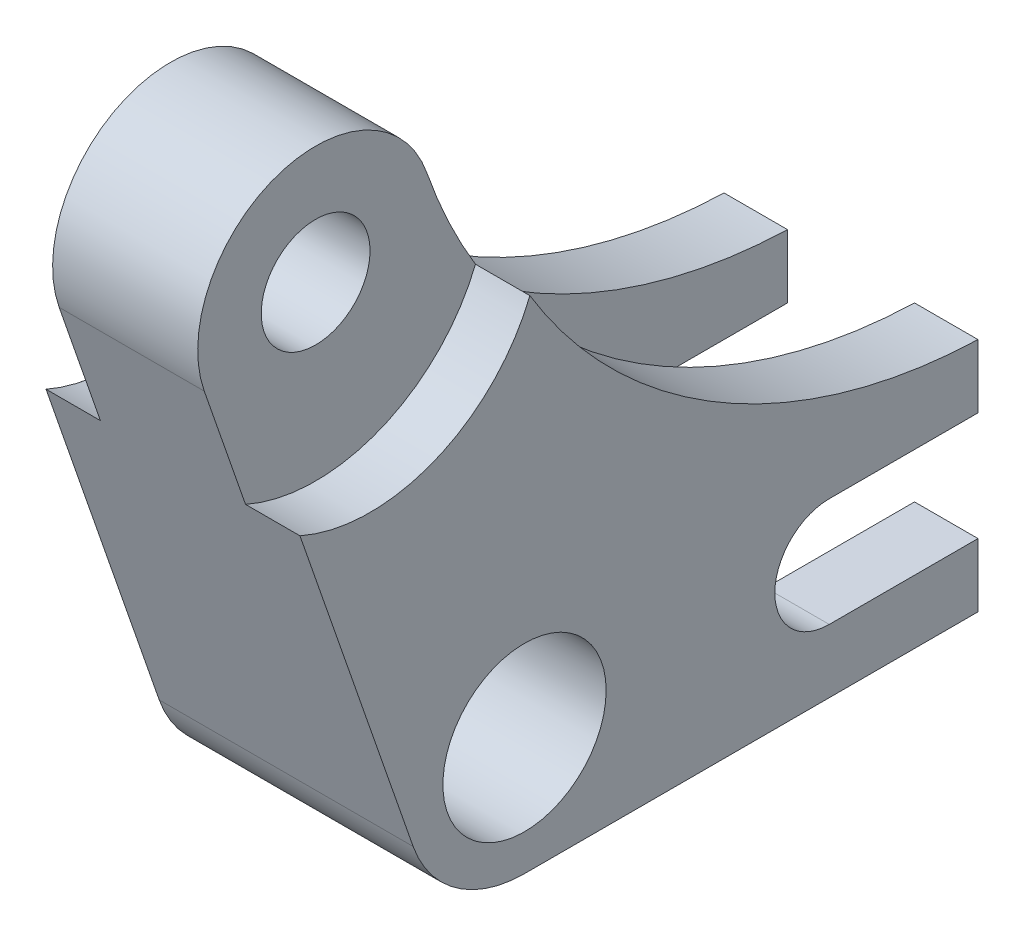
ISO-10303-21;
HEADER;
FILE_DESCRIPTION(('STEP AP214'),'2;1');
FILE_NAME('part.step','',(''),(''),'','','');
FILE_SCHEMA(('AUTOMOTIVE_DESIGN { 1 0 10303 214 1 1 1 1 }'));
ENDSEC;
DATA;
#1=APPLICATION_CONTEXT('core data for automotive mechanical design processes');
#2=APPLICATION_PROTOCOL_DEFINITION('international standard','automotive_design',2000,#1);
#3=PRODUCT_CONTEXT('',#1,'mechanical');
#4=PRODUCT('Part','Part','',(#3));
#5=PRODUCT_RELATED_PRODUCT_CATEGORY('part','',(#4));
#6=PRODUCT_DEFINITION_FORMATION('','',#4);
#7=PRODUCT_DEFINITION_CONTEXT('part definition',#1,'design');
#8=PRODUCT_DEFINITION('design','',#6,#7);
#9=PRODUCT_DEFINITION_SHAPE('','',#8);
#10=(LENGTH_UNIT() NAMED_UNIT(*) SI_UNIT(.MILLI.,.METRE.));
#11=(NAMED_UNIT(*) PLANE_ANGLE_UNIT() SI_UNIT($,.RADIAN.));
#12=(NAMED_UNIT(*) SI_UNIT($,.STERADIAN.) SOLID_ANGLE_UNIT());
#13=UNCERTAINTY_MEASURE_WITH_UNIT(LENGTH_MEASURE(1.E-05),#10,'distance_accuracy_value','');
#14=(GEOMETRIC_REPRESENTATION_CONTEXT(3) GLOBAL_UNCERTAINTY_ASSIGNED_CONTEXT((#13)) GLOBAL_UNIT_ASSIGNED_CONTEXT((#10,
#11,#12)) REPRESENTATION_CONTEXT('',''));
#15=CARTESIAN_POINT('',(0.,0.,0.));
#16=DIRECTION('',(0.,0.,1.));
#17=DIRECTION('',(1.,0.,0.));
#18=AXIS2_PLACEMENT_3D('',#15,#16,#17);
#19=CARTESIAN_POINT('',(28.,49.,17.0333519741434));
#20=DIRECTION('',(-1.,0.,0.));
#21=DIRECTION('',(0.,0.,1.));
#22=AXIS2_PLACEMENT_3D('',#19,#20,#21);
#23=CYLINDRICAL_SURFACE('',#22,13.);
#24=CARTESIAN_POINT('',(22.,49.,17.0333519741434));
#25=DIRECTION('',(1.,0.,0.));
#26=DIRECTION('',(0.,0.,-1.));
#27=AXIS2_PLACEMENT_3D('',#24,#25,#26);
#28=CIRCLE('',#27,13.);
#29=CARTESIAN_POINT('',(22.,53.268504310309,4.75410643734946));
#30=VERTEX_POINT('',#29);
#31=CARTESIAN_POINT('',(22.,44.731495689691,29.3125975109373));
#32=VERTEX_POINT('',#31);
#33=EDGE_CURVE('E438',#30,#32,#28,.T.);
#34=ORIENTED_EDGE('',*,*,#33,.F.);
#35=DIRECTION('',(-1.,0.,0.));
#36=VECTOR('',#35,1.);
#37=CARTESIAN_POINT('',(28.,53.268504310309,4.75410643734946));
#38=LINE('',#37,#36);
#39=CARTESIAN_POINT('',(6.,53.268504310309,4.75410643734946));
#40=VERTEX_POINT('',#39);
#41=EDGE_CURVE('E259',#30,#40,#38,.T.);
#42=ORIENTED_EDGE('',*,*,#41,.T.);
#43=CARTESIAN_POINT('',(6.,49.,17.0333519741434));
#44=DIRECTION('',(1.,0.,0.));
#45=DIRECTION('',(0.,0.,-1.));
#46=AXIS2_PLACEMENT_3D('',#43,#44,#45);
#47=CIRCLE('',#46,13.);
#48=CARTESIAN_POINT('',(6.,44.731495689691,29.3125975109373));
#49=VERTEX_POINT('',#48);
#50=EDGE_CURVE('E294',#40,#49,#47,.T.);
#51=ORIENTED_EDGE('',*,*,#50,.T.);
#52=DIRECTION('',(-1.,0.,0.));
#53=VECTOR('',#52,1.);
#54=CARTESIAN_POINT('',(28.,44.731495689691,29.3125975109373));
#55=LINE('',#54,#53);
#56=EDGE_CURVE('E229',#32,#49,#55,.T.);
#57=ORIENTED_EDGE('',*,*,#56,.F.);
#58=EDGE_LOOP('',(#34,#42,#51,#57));
#59=FACE_BOUND('',#58,.T.);
#60=ADVANCED_FACE('F46',(#59),#23,.T.);
#61=CARTESIAN_POINT('',(28.,49.,17.0333519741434));
#62=DIRECTION('',(-1.,0.,0.));
#63=DIRECTION('',(0.,0.,1.));
#64=AXIS2_PLACEMENT_3D('',#61,#62,#63);
#65=CYLINDRICAL_SURFACE('',#64,6.);
#66=CARTESIAN_POINT('',(6.,49.,17.0333519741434));
#67=DIRECTION('',(1.,0.,0.));
#68=DIRECTION('',(0.,0.,-1.));
#69=AXIS2_PLACEMENT_3D('',#66,#67,#68);
#70=CIRCLE('',#69,6.);
#71=CARTESIAN_POINT('',(6.,49.,11.0333519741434));
#72=VERTEX_POINT('',#71);
#73=EDGE_CURVE('E285',#72,#72,#70,.T.);
#74=ORIENTED_EDGE('',*,*,#73,.F.);
#75=EDGE_LOOP('',(#74));
#76=FACE_BOUND('',#75,.T.);
#77=CARTESIAN_POINT('',(22.,49.,17.0333519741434));
#78=DIRECTION('',(1.,0.,0.));
#79=DIRECTION('',(0.,0.,-1.));
#80=AXIS2_PLACEMENT_3D('',#77,#78,#79);
#81=CIRCLE('',#80,6.);
#82=CARTESIAN_POINT('',(22.,49.,11.0333519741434));
#83=VERTEX_POINT('',#82);
#84=EDGE_CURVE('E50',#83,#83,#81,.T.);
#85=ORIENTED_EDGE('',*,*,#84,.T.);
#86=EDGE_LOOP('',(#85));
#87=FACE_BOUND('',#86,.T.);
#88=ADVANCED_FACE('F531',(#76,#87),#65,.F.);
#89=CARTESIAN_POINT('',(28.,72.969293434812,-51.9193345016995));
#90=DIRECTION('',(-1.,0.,0.));
#91=DIRECTION('',(0.,0.,1.));
#92=AXIS2_PLACEMENT_3D('',#89,#90,#91);
#93=CYLINDRICAL_SURFACE('',#92,60.);
#94=CARTESIAN_POINT('',(22.,72.969293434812,-51.9193345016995));
#95=DIRECTION('',(1.,0.,0.));
#96=DIRECTION('',(0.,0.,-1.));
#97=AXIS2_PLACEMENT_3D('',#94,#95,#96);
#98=CIRCLE('',#97,60.);
#99=CARTESIAN_POINT('',(22.,41.8998051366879,-0.59013329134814));
#100=VERTEX_POINT('',#99);
#101=EDGE_CURVE('E63',#100,#30,#98,.F.);
#102=ORIENTED_EDGE('',*,*,#101,.F.);
#103=DIRECTION('',(1.,0.,0.));
#104=VECTOR('',#103,1.);
#105=CARTESIAN_POINT('',(25.,41.8998051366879,-0.590133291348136));
#106=LINE('',#105,#104);
#107=CARTESIAN_POINT('',(28.,41.8998051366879,-0.59013329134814));
#108=VERTEX_POINT('',#107);
#109=EDGE_CURVE('E208',#100,#108,#106,.T.);
#110=ORIENTED_EDGE('',*,*,#109,.T.);
#111=CARTESIAN_POINT('',(28.,72.969293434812,-51.9193345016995));
#112=DIRECTION('',(-1.,0.,0.));
#113=DIRECTION('',(0.,0.,-1.));
#114=AXIS2_PLACEMENT_3D('',#111,#112,#113);
#115=CIRCLE('',#114,60.);
#116=CARTESIAN_POINT('',(28.,13.,-50.));
#117=VERTEX_POINT('',#116);
#118=EDGE_CURVE('E218',#117,#108,#115,.T.);
#119=ORIENTED_EDGE('',*,*,#118,.F.);
#120=DIRECTION('',(-1.,0.,0.));
#121=VECTOR('',#120,1.);
#122=CARTESIAN_POINT('',(28.,13.,-50.));
#123=LINE('',#122,#121);
#124=CARTESIAN_POINT('',(21.,13.,-50.));
#125=VERTEX_POINT('',#124);
#126=EDGE_CURVE('E263',#117,#125,#123,.T.);
#127=ORIENTED_EDGE('',*,*,#126,.T.);
#128=CARTESIAN_POINT('',(21.,72.969293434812,-51.9193345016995));
#129=DIRECTION('',(1.,0.,0.));
#130=DIRECTION('',(0.,0.,-1.));
#131=AXIS2_PLACEMENT_3D('',#128,#129,#130);
#132=CIRCLE('',#131,60.);
#133=CARTESIAN_POINT('',(21.,28.1759152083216,-12.));
#134=VERTEX_POINT('',#133);
#135=EDGE_CURVE('E350',#125,#134,#132,.F.);
#136=ORIENTED_EDGE('',*,*,#135,.T.);
#137=DIRECTION('',(-1.,0.,0.));
#138=VECTOR('',#137,1.);
#139=CARTESIAN_POINT('',(28.,28.1759152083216,-12.));
#140=LINE('',#139,#138);
#141=CARTESIAN_POINT('',(7.,28.1759152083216,-12.));
#142=VERTEX_POINT('',#141);
#143=EDGE_CURVE('E56',#134,#142,#140,.T.);
#144=ORIENTED_EDGE('',*,*,#143,.T.);
#145=CARTESIAN_POINT('',(7.,72.969293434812,-51.9193345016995));
#146=DIRECTION('',(-1.,0.,0.));
#147=DIRECTION('',(0.,0.,1.));
#148=AXIS2_PLACEMENT_3D('',#145,#146,#147);
#149=CIRCLE('',#148,60.);
#150=CARTESIAN_POINT('',(7.,13.,-50.));
#151=VERTEX_POINT('',#150);
#152=EDGE_CURVE('E360',#142,#151,#149,.F.);
#153=ORIENTED_EDGE('',*,*,#152,.T.);
#154=CARTESIAN_POINT('',(0.,13.,-50.));
#155=VERTEX_POINT('',#154);
#156=EDGE_CURVE('E262',#151,#155,#123,.T.);
#157=ORIENTED_EDGE('',*,*,#156,.T.);
#158=CARTESIAN_POINT('',(0.,72.969293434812,-51.9193345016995));
#159=DIRECTION('',(-1.,0.,0.));
#160=DIRECTION('',(0.,0.,-1.));
#161=AXIS2_PLACEMENT_3D('',#158,#159,#160);
#162=CIRCLE('',#161,60.);
#163=CARTESIAN_POINT('',(0.,41.8998051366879,-0.59013329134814));
#164=VERTEX_POINT('',#163);
#165=EDGE_CURVE('E249',#155,#164,#162,.T.);
#166=ORIENTED_EDGE('',*,*,#165,.T.);
#167=DIRECTION('',(-1.,0.,0.));
#168=VECTOR('',#167,1.);
#169=CARTESIAN_POINT('',(3.,41.8998051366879,-0.590133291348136));
#170=LINE('',#169,#168);
#171=CARTESIAN_POINT('',(6.,41.8998051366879,-0.59013329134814));
#172=VERTEX_POINT('',#171);
#173=EDGE_CURVE('E312',#172,#164,#170,.T.);
#174=ORIENTED_EDGE('',*,*,#173,.F.);
#175=CARTESIAN_POINT('',(6.,72.969293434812,-51.9193345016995));
#176=DIRECTION('',(1.,0.,0.));
#177=DIRECTION('',(0.,0.,-1.));
#178=AXIS2_PLACEMENT_3D('',#175,#176,#177);
#179=CIRCLE('',#178,60.);
#180=EDGE_CURVE('E308',#172,#40,#179,.F.);
#181=ORIENTED_EDGE('',*,*,#180,.T.);
#182=ORIENTED_EDGE('',*,*,#41,.F.);
#183=EDGE_LOOP('',(#102,#110,#119,#127,#136,#144,#153,#157,#166,#174,#181,#182));
#184=FACE_BOUND('',#183,.T.);
#185=ADVANCED_FACE('F430',(#184),#93,.F.);
#186=CARTESIAN_POINT('',(28.,-4.26850431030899,12.2792455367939));
#187=DIRECTION('',(0.,0.328346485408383,-0.944557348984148));
#188=DIRECTION('',(0.,0.944557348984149,0.328346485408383));
#189=AXIS2_PLACEMENT_3D('',#186,#187,#188);
#190=PLANE('',#189);
#191=DIRECTION('',(0.,-0.944557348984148,-0.328346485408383));
#192=VECTOR('',#191,1.);
#193=CARTESIAN_POINT('',(28.,-4.26850431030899,12.2792455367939));
#194=LINE('',#193,#192);
#195=CARTESIAN_POINT('',(28.,31.6433251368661,24.7628951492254));
#196=VERTEX_POINT('',#195);
#197=CARTESIAN_POINT('',(28.,-4.26850431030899,12.2792455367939));
#198=VERTEX_POINT('',#197);
#199=EDGE_CURVE('E215',#196,#198,#194,.T.);
#200=ORIENTED_EDGE('',*,*,#199,.F.);
#201=DIRECTION('',(1.,0.,0.));
#202=VECTOR('',#201,1.);
#203=CARTESIAN_POINT('',(22.,31.6433251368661,24.7628951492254));
#204=LINE('',#203,#202);
#205=CARTESIAN_POINT('',(22.,31.6433251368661,24.7628951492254));
#206=VERTEX_POINT('',#205);
#207=EDGE_CURVE('E198',#196,#206,#204,.F.);
#208=ORIENTED_EDGE('',*,*,#207,.T.);
#209=DIRECTION('',(0.,-0.944557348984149,-0.328346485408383));
#210=VECTOR('',#209,1.);
#211=CARTESIAN_POINT('',(22.,-4.26850431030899,12.2792455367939));
#212=LINE('',#211,#210);
#213=EDGE_CURVE('E435',#32,#206,#212,.T.);
#214=ORIENTED_EDGE('',*,*,#213,.F.);
#215=ORIENTED_EDGE('',*,*,#56,.T.);
#216=DIRECTION('',(0.,-0.944557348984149,-0.328346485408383));
#217=VECTOR('',#216,1.);
#218=CARTESIAN_POINT('',(6.,-4.26850431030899,12.2792455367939));
#219=LINE('',#218,#217);
#220=CARTESIAN_POINT('',(6.,31.6433251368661,24.7628951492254));
#221=VERTEX_POINT('',#220);
#222=EDGE_CURVE('E288',#49,#221,#219,.T.);
#223=ORIENTED_EDGE('',*,*,#222,.T.);
#224=DIRECTION('',(-1.,0.,0.));
#225=VECTOR('',#224,1.);
#226=CARTESIAN_POINT('',(6.,31.6433251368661,24.7628951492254));
#227=LINE('',#226,#225);
#228=CARTESIAN_POINT('',(0.,31.6433251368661,24.7628951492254));
#229=VERTEX_POINT('',#228);
#230=EDGE_CURVE('E12',#229,#221,#227,.F.);
#231=ORIENTED_EDGE('',*,*,#230,.F.);
#232=DIRECTION('',(0.,-0.944557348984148,-0.328346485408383));
#233=VECTOR('',#232,1.);
#234=CARTESIAN_POINT('',(0.,-4.26850431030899,12.2792455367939));
#235=LINE('',#234,#233);
#236=CARTESIAN_POINT('',(0.,-4.26850431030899,12.2792455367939));
#237=VERTEX_POINT('',#236);
#238=EDGE_CURVE('E253',#229,#237,#235,.T.);
#239=ORIENTED_EDGE('',*,*,#238,.T.);
#240=DIRECTION('',(-1.,0.,0.));
#241=VECTOR('',#240,1.);
#242=CARTESIAN_POINT('',(28.,-4.26850431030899,12.2792455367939));
#243=LINE('',#242,#241);
#244=EDGE_CURVE('E223',#198,#237,#243,.T.);
#245=ORIENTED_EDGE('',*,*,#244,.F.);
#246=EDGE_LOOP('',(#200,#208,#214,#215,#223,#231,#239,#245));
#247=FACE_BOUND('',#246,.T.);
#248=ADVANCED_FACE('F221',(#247),#190,.F.);
#249=CARTESIAN_POINT('',(28.,-13.,-50.));
#250=DIRECTION('',(0.,0.,1.));
#251=DIRECTION('',(1.,0.,0.));
#252=AXIS2_PLACEMENT_3D('',#249,#250,#251);
#253=PLANE('',#252);
#254=ORIENTED_EDGE('',*,*,#156,.F.);
#255=DIRECTION('',(0.,1.,0.));
#256=VECTOR('',#255,1.);
#257=CARTESIAN_POINT('',(7.,-13.,-50.));
#258=LINE('',#257,#256);
#259=CARTESIAN_POINT('',(7.,5.99999999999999,-50.));
#260=VERTEX_POINT('',#259);
#261=EDGE_CURVE('E332',#260,#151,#258,.T.);
#262=ORIENTED_EDGE('',*,*,#261,.F.);
#263=DIRECTION('',(-1.,0.,0.));
#264=VECTOR('',#263,1.);
#265=CARTESIAN_POINT('',(28.,6.,-50.));
#266=LINE('',#265,#264);
#267=CARTESIAN_POINT('',(0.,6.,-50.));
#268=VERTEX_POINT('',#267);
#269=EDGE_CURVE('E400',#260,#268,#266,.T.);
#270=ORIENTED_EDGE('',*,*,#269,.T.);
#271=DIRECTION('',(0.,1.,0.));
#272=VECTOR('',#271,1.);
#273=CARTESIAN_POINT('',(0.,-13.,-50.));
#274=LINE('',#273,#272);
#275=EDGE_CURVE('E244',#268,#155,#274,.T.);
#276=ORIENTED_EDGE('',*,*,#275,.T.);
#277=EDGE_LOOP('',(#254,#262,#270,#276));
#278=FACE_BOUND('',#277,.T.);
#279=ADVANCED_FACE('F492',(#278),#253,.F.);
#280=DIRECTION('',(-1.,0.,0.));
#281=VECTOR('',#280,1.);
#282=CARTESIAN_POINT('',(28.,-6.,-50.));
#283=LINE('',#282,#281);
#284=CARTESIAN_POINT('',(7.,-6.,-50.));
#285=VERTEX_POINT('',#284);
#286=CARTESIAN_POINT('',(0.,-6.,-50.));
#287=VERTEX_POINT('',#286);
#288=EDGE_CURVE('E375',#285,#287,#283,.T.);
#289=ORIENTED_EDGE('',*,*,#288,.F.);
#290=CARTESIAN_POINT('',(7.,-13.,-50.));
#291=VERTEX_POINT('',#290);
#292=EDGE_CURVE('E328',#291,#285,#258,.T.);
#293=ORIENTED_EDGE('',*,*,#292,.F.);
#294=DIRECTION('',(-1.,0.,0.));
#295=VECTOR('',#294,1.);
#296=CARTESIAN_POINT('',(28.,-13.,-50.));
#297=LINE('',#296,#295);
#298=CARTESIAN_POINT('',(0.,-13.,-50.));
#299=VERTEX_POINT('',#298);
#300=EDGE_CURVE('E267',#291,#299,#297,.T.);
#301=ORIENTED_EDGE('',*,*,#300,.T.);
#302=EDGE_CURVE('E245',#299,#287,#274,.T.);
#303=ORIENTED_EDGE('',*,*,#302,.T.);
#304=EDGE_LOOP('',(#289,#293,#301,#303));
#305=FACE_BOUND('',#304,.T.);
#306=ADVANCED_FACE('F512',(#305),#253,.F.);
#307=CARTESIAN_POINT('',(28.,6.,-50.));
#308=DIRECTION('',(0.,-1.,0.));
#309=DIRECTION('',(0.,0.,-1.));
#310=AXIS2_PLACEMENT_3D('',#307,#308,#309);
#311=PLANE('',#310);
#312=DIRECTION('',(0.,0.,-1.));
#313=VECTOR('',#312,1.);
#314=CARTESIAN_POINT('',(7.,6.,-50.));
#315=LINE('',#314,#313);
#316=CARTESIAN_POINT('',(7.,6.,-33.5995788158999));
#317=VERTEX_POINT('',#316);
#318=EDGE_CURVE('E357',#317,#260,#315,.T.);
#319=ORIENTED_EDGE('',*,*,#318,.F.);
#320=DIRECTION('',(-1.,0.,0.));
#321=VECTOR('',#320,1.);
#322=CARTESIAN_POINT('',(28.,6.,-33.5995788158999));
#323=LINE('',#322,#321);
#324=CARTESIAN_POINT('',(0.,6.,-33.5995788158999));
#325=VERTEX_POINT('',#324);
#326=EDGE_CURVE('E395',#317,#325,#323,.T.);
#327=ORIENTED_EDGE('',*,*,#326,.T.);
#328=DIRECTION('',(0.,0.,1.));
#329=VECTOR('',#328,1.);
#330=CARTESIAN_POINT('',(0.,6.,-50.));
#331=LINE('',#330,#329);
#332=EDGE_CURVE('E364',#268,#325,#331,.T.);
#333=ORIENTED_EDGE('',*,*,#332,.F.);
#334=ORIENTED_EDGE('',*,*,#269,.F.);
#335=EDGE_LOOP('',(#319,#327,#333,#334));
#336=FACE_BOUND('',#335,.T.);
#337=ADVANCED_FACE('F499',(#336),#311,.T.);
#338=CARTESIAN_POINT('',(28.,0.,-33.5995788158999));
#339=DIRECTION('',(-1.,0.,0.));
#340=DIRECTION('',(0.,0.,1.));
#341=AXIS2_PLACEMENT_3D('',#338,#339,#340);
#342=CYLINDRICAL_SURFACE('',#341,6.);
#343=CARTESIAN_POINT('',(7.,0.,-33.5995788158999));
#344=DIRECTION('',(-1.,0.,0.));
#345=DIRECTION('',(0.,0.,1.));
#346=AXIS2_PLACEMENT_3D('',#343,#344,#345);
#347=CIRCLE('',#346,6.);
#348=CARTESIAN_POINT('',(7.,-6.,-33.5995788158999));
#349=VERTEX_POINT('',#348);
#350=EDGE_CURVE('E354',#349,#317,#347,.T.);
#351=ORIENTED_EDGE('',*,*,#350,.F.);
#352=DIRECTION('',(-1.,0.,0.));
#353=VECTOR('',#352,1.);
#354=CARTESIAN_POINT('',(28.,-6.,-33.5995788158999));
#355=LINE('',#354,#353);
#356=CARTESIAN_POINT('',(0.,-6.,-33.5995788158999));
#357=VERTEX_POINT('',#356);
#358=EDGE_CURVE('E390',#349,#357,#355,.T.);
#359=ORIENTED_EDGE('',*,*,#358,.T.);
#360=CARTESIAN_POINT('',(0.,0.,-33.5995788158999));
#361=DIRECTION('',(1.,0.,0.));
#362=DIRECTION('',(0.,0.,-1.));
#363=AXIS2_PLACEMENT_3D('',#360,#361,#362);
#364=CIRCLE('',#363,6.);
#365=EDGE_CURVE('E379',#325,#357,#364,.T.);
#366=ORIENTED_EDGE('',*,*,#365,.F.);
#367=ORIENTED_EDGE('',*,*,#326,.F.);
#368=EDGE_LOOP('',(#351,#359,#366,#367));
#369=FACE_BOUND('',#368,.T.);
#370=ADVANCED_FACE('F503',(#369),#342,.F.);
#371=CARTESIAN_POINT('',(28.,-6.,-50.));
#372=DIRECTION('',(0.,1.,0.));
#373=DIRECTION('',(0.,0.,1.));
#374=AXIS2_PLACEMENT_3D('',#371,#372,#373);
#375=PLANE('',#374);
#376=DIRECTION('',(0.,0.,1.));
#377=VECTOR('',#376,1.);
#378=CARTESIAN_POINT('',(7.,-6.,-50.));
#379=LINE('',#378,#377);
#380=EDGE_CURVE('E279',#285,#349,#379,.T.);
#381=ORIENTED_EDGE('',*,*,#380,.F.);
#382=ORIENTED_EDGE('',*,*,#288,.T.);
#383=DIRECTION('',(0.,0.,-1.));
#384=VECTOR('',#383,1.);
#385=CARTESIAN_POINT('',(0.,-6.,-50.));
#386=LINE('',#385,#384);
#387=EDGE_CURVE('E369',#357,#287,#386,.T.);
#388=ORIENTED_EDGE('',*,*,#387,.F.);
#389=ORIENTED_EDGE('',*,*,#358,.F.);
#390=EDGE_LOOP('',(#381,#382,#388,#389));
#391=FACE_BOUND('',#390,.T.);
#392=ADVANCED_FACE('F508',(#391),#375,.T.);
#393=CARTESIAN_POINT('',(28.,0.,0.));
#394=DIRECTION('',(1.,0.,0.));
#395=DIRECTION('',(0.,0.,-1.));
#396=AXIS2_PLACEMENT_3D('',#393,#394,#395);
#397=PLANE('',#396);
#398=CARTESIAN_POINT('',(28.,49.,17.0333519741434));
#399=DIRECTION('',(1.,0.,0.));
#400=DIRECTION('',(0.,0.,-1.));
#401=AXIS2_PLACEMENT_3D('',#398,#399,#400);
#402=CIRCLE('',#401,19.);
#403=EDGE_CURVE('E201',#196,#108,#402,.T.);
#404=ORIENTED_EDGE('',*,*,#403,.F.);
#405=ORIENTED_EDGE('',*,*,#199,.T.);
#406=CARTESIAN_POINT('',(28.,0.,0.));
#407=DIRECTION('',(1.,0.,0.));
#408=DIRECTION('',(0.,0.,-1.));
#409=AXIS2_PLACEMENT_3D('',#406,#407,#408);
#410=CIRCLE('',#409,13.);
#411=CARTESIAN_POINT('',(28.,-13.,-1.36167772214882E-13));
#412=VERTEX_POINT('',#411);
#413=EDGE_CURVE('E255',#198,#412,#410,.T.);
#414=ORIENTED_EDGE('',*,*,#413,.T.);
#415=DIRECTION('',(0.,0.,-1.));
#416=VECTOR('',#415,1.);
#417=CARTESIAN_POINT('',(28.,-13.,-1.36167772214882E-13));
#418=LINE('',#417,#416);
#419=CARTESIAN_POINT('',(28.,-13.,-50.));
#420=VERTEX_POINT('',#419);
#421=EDGE_CURVE('E414',#412,#420,#418,.T.);
#422=ORIENTED_EDGE('',*,*,#421,.T.);
#423=DIRECTION('',(0.,1.,0.));
#424=VECTOR('',#423,1.);
#425=CARTESIAN_POINT('',(28.,-13.,-50.));
#426=LINE('',#425,#424);
#427=CARTESIAN_POINT('',(28.,-6.,-50.));
#428=VERTEX_POINT('',#427);
#429=EDGE_CURVE('E231',#420,#428,#426,.T.);
#430=ORIENTED_EDGE('',*,*,#429,.T.);
#431=DIRECTION('',(0.,0.,-1.));
#432=VECTOR('',#431,1.);
#433=CARTESIAN_POINT('',(28.,-6.,-50.));
#434=LINE('',#433,#432);
#435=CARTESIAN_POINT('',(28.,-6.,-33.5995788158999));
#436=VERTEX_POINT('',#435);
#437=EDGE_CURVE('E372',#436,#428,#434,.T.);
#438=ORIENTED_EDGE('',*,*,#437,.F.);
#439=CARTESIAN_POINT('',(28.,0.,-33.5995788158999));
#440=DIRECTION('',(1.,0.,0.));
#441=DIRECTION('',(0.,0.,-1.));
#442=AXIS2_PLACEMENT_3D('',#439,#440,#441);
#443=CIRCLE('',#442,6.);
#444=CARTESIAN_POINT('',(28.,6.,-33.5995788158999));
#445=VERTEX_POINT('',#444);
#446=EDGE_CURVE('E368',#445,#436,#443,.T.);
#447=ORIENTED_EDGE('',*,*,#446,.F.);
#448=DIRECTION('',(0.,0.,1.));
#449=VECTOR('',#448,1.);
#450=CARTESIAN_POINT('',(28.,6.,-50.));
#451=LINE('',#450,#449);
#452=CARTESIAN_POINT('',(28.,6.,-50.));
#453=VERTEX_POINT('',#452);
#454=EDGE_CURVE('E365',#453,#445,#451,.T.);
#455=ORIENTED_EDGE('',*,*,#454,.F.);
#456=EDGE_CURVE('E416',#453,#117,#426,.T.);
#457=ORIENTED_EDGE('',*,*,#456,.T.);
#458=ORIENTED_EDGE('',*,*,#118,.T.);
#459=EDGE_LOOP('',(#404,#405,#414,#422,#430,#438,#447,#455,#457,#458));
#460=FACE_BOUND('',#459,.T.);
#461=CARTESIAN_POINT('',(28.,0.,0.));
#462=DIRECTION('',(1.,0.,0.));
#463=DIRECTION('',(0.,0.,-1.));
#464=AXIS2_PLACEMENT_3D('',#461,#462,#463);
#465=CIRCLE('',#464,9.);
#466=CARTESIAN_POINT('',(28.,0.,-9.));
#467=VERTEX_POINT('',#466);
#468=EDGE_CURVE('E240',#467,#467,#465,.T.);
#469=ORIENTED_EDGE('',*,*,#468,.F.);
#470=EDGE_LOOP('',(#469));
#471=FACE_BOUND('',#470,.T.);
#472=ADVANCED_FACE('F212',(#460,#471),#397,.T.);
#473=CARTESIAN_POINT('',(0.,0.,0.));
#474=DIRECTION('',(1.,0.,0.));
#475=DIRECTION('',(0.,0.,-1.));
#476=AXIS2_PLACEMENT_3D('',#473,#474,#475);
#477=PLANE('',#476);
#478=CARTESIAN_POINT('',(0.,49.,17.0333519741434));
#479=DIRECTION('',(1.,0.,0.));
#480=DIRECTION('',(0.,0.,-1.));
#481=AXIS2_PLACEMENT_3D('',#478,#479,#480);
#482=CIRCLE('',#481,19.);
#483=EDGE_CURVE('E296',#229,#164,#482,.T.);
#484=ORIENTED_EDGE('',*,*,#483,.T.);
#485=ORIENTED_EDGE('',*,*,#165,.F.);
#486=ORIENTED_EDGE('',*,*,#275,.F.);
#487=ORIENTED_EDGE('',*,*,#332,.T.);
#488=ORIENTED_EDGE('',*,*,#365,.T.);
#489=ORIENTED_EDGE('',*,*,#387,.T.);
#490=ORIENTED_EDGE('',*,*,#302,.F.);
#491=DIRECTION('',(0.,0.,-1.));
#492=VECTOR('',#491,1.);
#493=CARTESIAN_POINT('',(0.,-13.,-1.36167772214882E-13));
#494=LINE('',#493,#492);
#495=CARTESIAN_POINT('',(0.,-13.,-1.36167772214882E-13));
#496=VERTEX_POINT('',#495);
#497=EDGE_CURVE('E239',#496,#299,#494,.T.);
#498=ORIENTED_EDGE('',*,*,#497,.F.);
#499=CARTESIAN_POINT('',(0.,0.,0.));
#500=DIRECTION('',(1.,0.,0.));
#501=DIRECTION('',(0.,0.,-1.));
#502=AXIS2_PLACEMENT_3D('',#499,#500,#501);
#503=CIRCLE('',#502,13.);
#504=EDGE_CURVE('E235',#237,#496,#503,.T.);
#505=ORIENTED_EDGE('',*,*,#504,.F.);
#506=ORIENTED_EDGE('',*,*,#238,.F.);
#507=EDGE_LOOP('',(#484,#485,#486,#487,#488,#489,#490,#498,#505,#506));
#508=FACE_BOUND('',#507,.T.);
#509=CARTESIAN_POINT('',(0.,0.,0.));
#510=DIRECTION('',(1.,0.,0.));
#511=DIRECTION('',(0.,0.,-1.));
#512=AXIS2_PLACEMENT_3D('',#509,#510,#511);
#513=CIRCLE('',#512,9.);
#514=CARTESIAN_POINT('',(0.,0.,-9.));
#515=VERTEX_POINT('',#514);
#516=EDGE_CURVE('E405',#515,#515,#513,.T.);
#517=ORIENTED_EDGE('',*,*,#516,.T.);
#518=EDGE_LOOP('',(#517));
#519=FACE_BOUND('',#518,.T.);
#520=ADVANCED_FACE('F455',(#508,#519),#477,.F.);
#521=CARTESIAN_POINT('',(21.,5.99999999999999,-50.));
#522=VERTEX_POINT('',#521);
#523=EDGE_CURVE('E401',#453,#522,#266,.T.);
#524=ORIENTED_EDGE('',*,*,#523,.T.);
#525=DIRECTION('',(0.,1.,0.));
#526=VECTOR('',#525,1.);
#527=CARTESIAN_POINT('',(21.,-13.,-50.));
#528=LINE('',#527,#526);
#529=EDGE_CURVE('E337',#522,#125,#528,.T.);
#530=ORIENTED_EDGE('',*,*,#529,.T.);
#531=ORIENTED_EDGE('',*,*,#126,.F.);
#532=ORIENTED_EDGE('',*,*,#456,.F.);
#533=EDGE_LOOP('',(#524,#530,#531,#532));
#534=FACE_BOUND('',#533,.T.);
#535=ADVANCED_FACE('F428',(#534),#253,.F.);
#536=CARTESIAN_POINT('',(21.,-13.,-50.));
#537=VERTEX_POINT('',#536);
#538=EDGE_CURVE('E268',#420,#537,#297,.T.);
#539=ORIENTED_EDGE('',*,*,#538,.T.);
#540=CARTESIAN_POINT('',(21.,-6.,-50.));
#541=VERTEX_POINT('',#540);
#542=EDGE_CURVE('E333',#537,#541,#528,.T.);
#543=ORIENTED_EDGE('',*,*,#542,.T.);
#544=EDGE_CURVE('E386',#428,#541,#283,.T.);
#545=ORIENTED_EDGE('',*,*,#544,.F.);
#546=ORIENTED_EDGE('',*,*,#429,.F.);
#547=EDGE_LOOP('',(#539,#543,#545,#546));
#548=FACE_BOUND('',#547,.T.);
#549=ADVANCED_FACE('F468',(#548),#253,.F.);
#550=CARTESIAN_POINT('',(28.,0.,0.));
#551=DIRECTION('',(-1.,0.,0.));
#552=DIRECTION('',(0.,0.,1.));
#553=AXIS2_PLACEMENT_3D('',#550,#551,#552);
#554=CYLINDRICAL_SURFACE('',#553,13.);
#555=ORIENTED_EDGE('',*,*,#504,.T.);
#556=DIRECTION('',(-1.,0.,0.));
#557=VECTOR('',#556,1.);
#558=CARTESIAN_POINT('',(28.,-13.,-1.36167772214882E-13));
#559=LINE('',#558,#557);
#560=EDGE_CURVE('E272',#412,#496,#559,.T.);
#561=ORIENTED_EDGE('',*,*,#560,.F.);
#562=ORIENTED_EDGE('',*,*,#413,.F.);
#563=ORIENTED_EDGE('',*,*,#244,.T.);
#564=EDGE_LOOP('',(#555,#561,#562,#563));
#565=FACE_BOUND('',#564,.T.);
#566=ADVANCED_FACE('F48',(#565),#554,.T.);
#567=CARTESIAN_POINT('',(28.,-13.,-1.36167772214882E-13));
#568=DIRECTION('',(0.,1.,0.));
#569=DIRECTION('',(0.,0.,1.));
#570=AXIS2_PLACEMENT_3D('',#567,#568,#569);
#571=PLANE('',#570);
#572=ORIENTED_EDGE('',*,*,#300,.F.);
#573=DIRECTION('',(0.,0.,1.));
#574=VECTOR('',#573,1.);
#575=CARTESIAN_POINT('',(7.,-13.,-50.));
#576=LINE('',#575,#574);
#577=CARTESIAN_POINT('',(7.,-13.,-12.));
#578=VERTEX_POINT('',#577);
#579=EDGE_CURVE('E315',#291,#578,#576,.T.);
#580=ORIENTED_EDGE('',*,*,#579,.T.);
#581=DIRECTION('',(1.,0.,0.));
#582=VECTOR('',#581,1.);
#583=CARTESIAN_POINT('',(7.,-13.,-12.));
#584=LINE('',#583,#582);
#585=CARTESIAN_POINT('',(21.,-13.,-12.));
#586=VERTEX_POINT('',#585);
#587=EDGE_CURVE('E319',#578,#586,#584,.T.);
#588=ORIENTED_EDGE('',*,*,#587,.T.);
#589=DIRECTION('',(0.,0.,-1.));
#590=VECTOR('',#589,1.);
#591=CARTESIAN_POINT('',(21.,-13.,-50.));
#592=LINE('',#591,#590);
#593=EDGE_CURVE('E323',#586,#537,#592,.T.);
#594=ORIENTED_EDGE('',*,*,#593,.T.);
#595=ORIENTED_EDGE('',*,*,#538,.F.);
#596=ORIENTED_EDGE('',*,*,#421,.F.);
#597=ORIENTED_EDGE('',*,*,#560,.T.);
#598=ORIENTED_EDGE('',*,*,#497,.T.);
#599=EDGE_LOOP('',(#572,#580,#588,#594,#595,#596,#597,#598));
#600=FACE_BOUND('',#599,.T.);
#601=ADVANCED_FACE('F464',(#600),#571,.F.);
#602=CARTESIAN_POINT('',(28.,0.,0.));
#603=DIRECTION('',(-1.,0.,0.));
#604=DIRECTION('',(0.,0.,1.));
#605=AXIS2_PLACEMENT_3D('',#602,#603,#604);
#606=CYLINDRICAL_SURFACE('',#605,9.);
#607=ORIENTED_EDGE('',*,*,#468,.T.);
#608=EDGE_LOOP('',(#607));
#609=FACE_BOUND('',#608,.T.);
#610=ORIENTED_EDGE('',*,*,#516,.F.);
#611=EDGE_LOOP('',(#610));
#612=FACE_BOUND('',#611,.T.);
#613=ADVANCED_FACE('F545',(#609,#612),#606,.F.);
#614=DIRECTION('',(0.,0.,1.));
#615=VECTOR('',#614,1.);
#616=CARTESIAN_POINT('',(21.,6.,-50.));
#617=LINE('',#616,#615);
#618=CARTESIAN_POINT('',(21.,6.,-33.5995788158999));
#619=VERTEX_POINT('',#618);
#620=EDGE_CURVE('E347',#522,#619,#617,.T.);
#621=ORIENTED_EDGE('',*,*,#620,.F.);
#622=ORIENTED_EDGE('',*,*,#523,.F.);
#623=ORIENTED_EDGE('',*,*,#454,.T.);
#624=EDGE_CURVE('E396',#445,#619,#323,.T.);
#625=ORIENTED_EDGE('',*,*,#624,.T.);
#626=EDGE_LOOP('',(#621,#622,#623,#625));
#627=FACE_BOUND('',#626,.T.);
#628=ADVANCED_FACE('F479',(#627),#311,.T.);
#629=CARTESIAN_POINT('',(21.,0.,-33.5995788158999));
#630=DIRECTION('',(1.,0.,0.));
#631=DIRECTION('',(0.,0.,-1.));
#632=AXIS2_PLACEMENT_3D('',#629,#630,#631);
#633=CIRCLE('',#632,6.);
#634=CARTESIAN_POINT('',(21.,-6.,-33.5995788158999));
#635=VERTEX_POINT('',#634);
#636=EDGE_CURVE('E331',#619,#635,#633,.T.);
#637=ORIENTED_EDGE('',*,*,#636,.F.);
#638=ORIENTED_EDGE('',*,*,#624,.F.);
#639=ORIENTED_EDGE('',*,*,#446,.T.);
#640=EDGE_CURVE('E391',#436,#635,#355,.T.);
#641=ORIENTED_EDGE('',*,*,#640,.T.);
#642=EDGE_LOOP('',(#637,#638,#639,#641));
#643=FACE_BOUND('',#642,.T.);
#644=ADVANCED_FACE('F476',(#643),#342,.F.);
#645=DIRECTION('',(0.,0.,-1.));
#646=VECTOR('',#645,1.);
#647=CARTESIAN_POINT('',(21.,-6.,-50.));
#648=LINE('',#647,#646);
#649=EDGE_CURVE('E276',#635,#541,#648,.T.);
#650=ORIENTED_EDGE('',*,*,#649,.F.);
#651=ORIENTED_EDGE('',*,*,#640,.F.);
#652=ORIENTED_EDGE('',*,*,#437,.T.);
#653=ORIENTED_EDGE('',*,*,#544,.T.);
#654=EDGE_LOOP('',(#650,#651,#652,#653));
#655=FACE_BOUND('',#654,.T.);
#656=ADVANCED_FACE('F471',(#655),#375,.T.);
#657=CARTESIAN_POINT('',(7.,-13.,-12.));
#658=DIRECTION('',(0.,0.,1.));
#659=DIRECTION('',(1.,0.,0.));
#660=AXIS2_PLACEMENT_3D('',#657,#658,#659);
#661=PLANE('',#660);
#662=DIRECTION('',(0.,1.,0.));
#663=VECTOR('',#662,1.);
#664=CARTESIAN_POINT('',(21.,-13.,-12.));
#665=LINE('',#664,#663);
#666=EDGE_CURVE('E338',#586,#134,#665,.T.);
#667=ORIENTED_EDGE('',*,*,#666,.F.);
#668=ORIENTED_EDGE('',*,*,#587,.F.);
#669=DIRECTION('',(0.,1.,0.));
#670=VECTOR('',#669,1.);
#671=CARTESIAN_POINT('',(7.,-13.,-12.));
#672=LINE('',#671,#670);
#673=EDGE_CURVE('E327',#578,#142,#672,.T.);
#674=ORIENTED_EDGE('',*,*,#673,.T.);
#675=ORIENTED_EDGE('',*,*,#143,.F.);
#676=EDGE_LOOP('',(#667,#668,#674,#675));
#677=FACE_BOUND('',#676,.T.);
#678=ADVANCED_FACE('F520',(#677),#661,.F.);
#679=CARTESIAN_POINT('',(7.,-13.,-50.));
#680=DIRECTION('',(-1.,0.,0.));
#681=DIRECTION('',(0.,0.,1.));
#682=AXIS2_PLACEMENT_3D('',#679,#680,#681);
#683=PLANE('',#682);
#684=ORIENTED_EDGE('',*,*,#673,.F.);
#685=ORIENTED_EDGE('',*,*,#579,.F.);
#686=ORIENTED_EDGE('',*,*,#292,.T.);
#687=ORIENTED_EDGE('',*,*,#380,.T.);
#688=ORIENTED_EDGE('',*,*,#350,.T.);
#689=ORIENTED_EDGE('',*,*,#318,.T.);
#690=ORIENTED_EDGE('',*,*,#261,.T.);
#691=ORIENTED_EDGE('',*,*,#152,.F.);
#692=EDGE_LOOP('',(#684,#685,#686,#687,#688,#689,#690,#691));
#693=FACE_BOUND('',#692,.T.);
#694=ADVANCED_FACE('F517',(#693),#683,.F.);
#695=CARTESIAN_POINT('',(21.,-13.,-50.));
#696=DIRECTION('',(1.,0.,0.));
#697=DIRECTION('',(0.,0.,-1.));
#698=AXIS2_PLACEMENT_3D('',#695,#696,#697);
#699=PLANE('',#698);
#700=ORIENTED_EDGE('',*,*,#529,.F.);
#701=ORIENTED_EDGE('',*,*,#620,.T.);
#702=ORIENTED_EDGE('',*,*,#636,.T.);
#703=ORIENTED_EDGE('',*,*,#649,.T.);
#704=ORIENTED_EDGE('',*,*,#542,.F.);
#705=ORIENTED_EDGE('',*,*,#593,.F.);
#706=ORIENTED_EDGE('',*,*,#666,.T.);
#707=ORIENTED_EDGE('',*,*,#135,.F.);
#708=EDGE_LOOP('',(#700,#701,#702,#703,#704,#705,#706,#707));
#709=FACE_BOUND('',#708,.T.);
#710=ADVANCED_FACE('F481',(#709),#699,.F.);
#711=CARTESIAN_POINT('',(6.,49.,17.0333519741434));
#712=DIRECTION('',(-1.,0.,0.));
#713=DIRECTION('',(0.,0.,1.));
#714=AXIS2_PLACEMENT_3D('',#711,#712,#713);
#715=CYLINDRICAL_SURFACE('',#714,19.);
#716=ORIENTED_EDGE('',*,*,#173,.T.);
#717=ORIENTED_EDGE('',*,*,#483,.F.);
#718=ORIENTED_EDGE('',*,*,#230,.T.);
#719=CARTESIAN_POINT('',(6.,49.,17.0333519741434));
#720=DIRECTION('',(1.,0.,0.));
#721=DIRECTION('',(0.,0.,-1.));
#722=AXIS2_PLACEMENT_3D('',#719,#720,#721);
#723=CIRCLE('',#722,19.);
#724=EDGE_CURVE('E71',#221,#172,#723,.T.);
#725=ORIENTED_EDGE('',*,*,#724,.T.);
#726=EDGE_LOOP('',(#716,#717,#718,#725));
#727=FACE_BOUND('',#726,.T.);
#728=ADVANCED_FACE('F451',(#727),#715,.F.);
#729=CARTESIAN_POINT('',(6.,49.,17.0333519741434));
#730=DIRECTION('',(1.,0.,0.));
#731=DIRECTION('',(0.,0.,-1.));
#732=AXIS2_PLACEMENT_3D('',#729,#730,#731);
#733=PLANE('',#732);
#734=ORIENTED_EDGE('',*,*,#73,.T.);
#735=EDGE_LOOP('',(#734));
#736=FACE_BOUND('',#735,.T.);
#737=ORIENTED_EDGE('',*,*,#724,.F.);
#738=ORIENTED_EDGE('',*,*,#222,.F.);
#739=ORIENTED_EDGE('',*,*,#50,.F.);
#740=ORIENTED_EDGE('',*,*,#180,.F.);
#741=EDGE_LOOP('',(#737,#738,#739,#740));
#742=FACE_BOUND('',#741,.T.);
#743=ADVANCED_FACE('F449',(#736,#742),#733,.F.);
#744=CARTESIAN_POINT('',(22.,49.,17.0333519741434));
#745=DIRECTION('',(1.,0.,0.));
#746=DIRECTION('',(0.,0.,-1.));
#747=AXIS2_PLACEMENT_3D('',#744,#745,#746);
#748=CYLINDRICAL_SURFACE('',#747,19.);
#749=CARTESIAN_POINT('',(22.,49.,17.0333519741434));
#750=DIRECTION('',(1.,0.,0.));
#751=DIRECTION('',(0.,0.,-1.));
#752=AXIS2_PLACEMENT_3D('',#749,#750,#751);
#753=CIRCLE('',#752,19.);
#754=EDGE_CURVE('E203',#206,#100,#753,.T.);
#755=ORIENTED_EDGE('',*,*,#754,.F.);
#756=ORIENTED_EDGE('',*,*,#207,.F.);
#757=ORIENTED_EDGE('',*,*,#403,.T.);
#758=ORIENTED_EDGE('',*,*,#109,.F.);
#759=EDGE_LOOP('',(#755,#756,#757,#758));
#760=FACE_BOUND('',#759,.T.);
#761=ADVANCED_FACE('F200',(#760),#748,.F.);
#762=CARTESIAN_POINT('',(22.,61.2792455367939,21.3018562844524));
#763=DIRECTION('',(1.,0.,0.));
#764=DIRECTION('',(0.,0.,-1.));
#765=AXIS2_PLACEMENT_3D('',#762,#763,#764);
#766=PLANE('',#765);
#767=ORIENTED_EDGE('',*,*,#84,.F.);
#768=EDGE_LOOP('',(#767));
#769=FACE_BOUND('',#768,.T.);
#770=ORIENTED_EDGE('',*,*,#101,.T.);
#771=ORIENTED_EDGE('',*,*,#33,.T.);
#772=ORIENTED_EDGE('',*,*,#213,.T.);
#773=ORIENTED_EDGE('',*,*,#754,.T.);
#774=EDGE_LOOP('',(#770,#771,#772,#773));
#775=FACE_BOUND('',#774,.T.);
#776=ADVANCED_FACE('F445',(#769,#775),#766,.T.);
#777=CLOSED_SHELL('',(#60,#88,#185,#248,#279,#306,#337,#370,#392,#472,#520,#535,#549,#566,#601,
#613,#628,#644,#656,#678,#694,#710,#728,#743,#761,#776));
#778=MANIFOLD_SOLID_BREP('B2',#777);
#779=ADVANCED_BREP_SHAPE_REPRESENTATION('',(#18,#778),#14);
#780=SHAPE_DEFINITION_REPRESENTATION(#9,#779);
ENDSEC;
END-ISO-10303-21;
